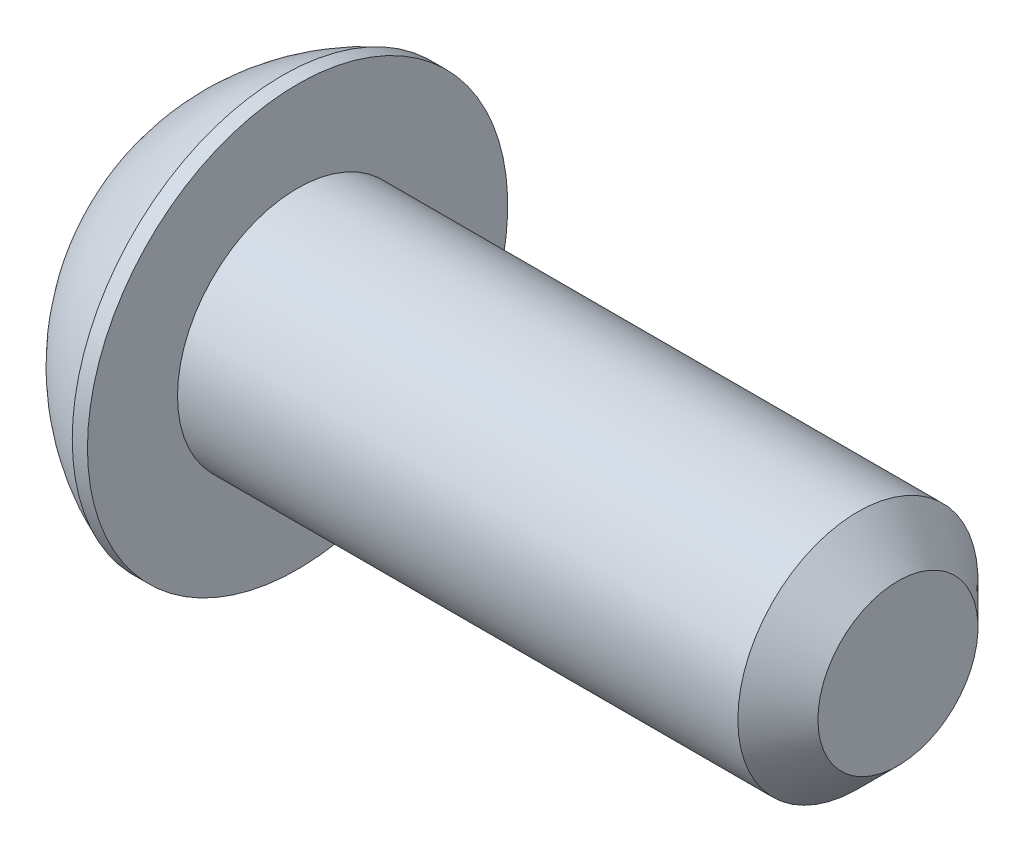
ISO-10303-21;
HEADER;
FILE_DESCRIPTION(('STEP AP214'),'2;1');
FILE_NAME('part.step','',(''),(''),'','','');
FILE_SCHEMA(('AUTOMOTIVE_DESIGN { 1 0 10303 214 1 1 1 1 }'));
ENDSEC;
DATA;
#1=APPLICATION_CONTEXT('core data for automotive mechanical design processes');
#2=APPLICATION_PROTOCOL_DEFINITION('international standard','automotive_design',2000,#1);
#3=PRODUCT_CONTEXT('',#1,'mechanical');
#4=PRODUCT('Part','Part','',(#3));
#5=PRODUCT_RELATED_PRODUCT_CATEGORY('part','',(#4));
#6=PRODUCT_DEFINITION_FORMATION('','',#4);
#7=PRODUCT_DEFINITION_CONTEXT('part definition',#1,'design');
#8=PRODUCT_DEFINITION('design','',#6,#7);
#9=PRODUCT_DEFINITION_SHAPE('','',#8);
#10=(LENGTH_UNIT() NAMED_UNIT(*) SI_UNIT(.MILLI.,.METRE.));
#11=(NAMED_UNIT(*) PLANE_ANGLE_UNIT() SI_UNIT($,.RADIAN.));
#12=(NAMED_UNIT(*) SI_UNIT($,.STERADIAN.) SOLID_ANGLE_UNIT());
#13=UNCERTAINTY_MEASURE_WITH_UNIT(LENGTH_MEASURE(1.E-05),#10,'distance_accuracy_value','');
#14=(GEOMETRIC_REPRESENTATION_CONTEXT(3) GLOBAL_UNCERTAINTY_ASSIGNED_CONTEXT((#13)) GLOBAL_UNIT_ASSIGNED_CONTEXT((#10,
#11,#12)) REPRESENTATION_CONTEXT('',''));
#15=CARTESIAN_POINT('',(0.,0.,0.));
#16=DIRECTION('',(0.,0.,1.));
#17=DIRECTION('',(1.,0.,0.));
#18=AXIS2_PLACEMENT_3D('',#15,#16,#17);
#19=CARTESIAN_POINT('',(0.,0.,0.));
#20=DIRECTION('',(-1.,0.,0.));
#21=DIRECTION('',(0.,0.,1.));
#22=AXIS2_PLACEMENT_3D('',#19,#20,#21);
#23=PLANE('',#22);
#24=CARTESIAN_POINT('',(0.,0.,0.));
#25=DIRECTION('',(-1.,0.,0.));
#26=DIRECTION('',(0.,0.,1.));
#27=AXIS2_PLACEMENT_3D('',#24,#25,#26);
#28=CIRCLE('',#27,2.625);
#29=CARTESIAN_POINT('',(0.,2.625,0.));
#30=VERTEX_POINT('',#29);
#31=EDGE_CURVE('E11',#30,#30,#28,.T.);
#32=ORIENTED_EDGE('',*,*,#31,.T.);
#33=EDGE_LOOP('',(#32));
#34=FACE_BOUND('',#33,.T.);
#35=DIRECTION('',(0.,-1.,0.));
#36=VECTOR('',#35,1.);
#37=CARTESIAN_POINT('',(0.,-1.15470053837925,2.));
#38=LINE('',#37,#36);
#39=CARTESIAN_POINT('',(0.,1.15470053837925,2.));
#40=VERTEX_POINT('',#39);
#41=CARTESIAN_POINT('',(0.,-1.15470053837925,2.));
#42=VERTEX_POINT('',#41);
#43=EDGE_CURVE('E55',#40,#42,#38,.T.);
#44=ORIENTED_EDGE('',*,*,#43,.T.);
#45=DIRECTION('',(0.,-0.5,-0.866025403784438));
#46=VECTOR('',#45,1.);
#47=CARTESIAN_POINT('',(0.,-2.3094010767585,0.));
#48=LINE('',#47,#46);
#49=CARTESIAN_POINT('',(0.,-2.3094010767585,0.));
#50=VERTEX_POINT('',#49);
#51=EDGE_CURVE('E381',#42,#50,#48,.T.);
#52=ORIENTED_EDGE('',*,*,#51,.T.);
#53=DIRECTION('',(0.,0.5,-0.866025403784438));
#54=VECTOR('',#53,1.);
#55=CARTESIAN_POINT('',(0.,-1.15470053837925,-2.));
#56=LINE('',#55,#54);
#57=CARTESIAN_POINT('',(0.,-1.15470053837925,-2.));
#58=VERTEX_POINT('',#57);
#59=EDGE_CURVE('E135',#50,#58,#56,.T.);
#60=ORIENTED_EDGE('',*,*,#59,.T.);
#61=DIRECTION('',(0.,1.,0.));
#62=VECTOR('',#61,1.);
#63=CARTESIAN_POINT('',(0.,1.15470053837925,-2.));
#64=LINE('',#63,#62);
#65=CARTESIAN_POINT('',(0.,1.15470053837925,-2.));
#66=VERTEX_POINT('',#65);
#67=EDGE_CURVE('E384',#58,#66,#64,.T.);
#68=ORIENTED_EDGE('',*,*,#67,.T.);
#69=DIRECTION('',(0.,0.5,0.866025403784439));
#70=VECTOR('',#69,1.);
#71=CARTESIAN_POINT('',(0.,2.3094010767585,0.));
#72=LINE('',#71,#70);
#73=CARTESIAN_POINT('',(0.,2.3094010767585,0.));
#74=VERTEX_POINT('',#73);
#75=EDGE_CURVE('E387',#66,#74,#72,.T.);
#76=ORIENTED_EDGE('',*,*,#75,.T.);
#77=DIRECTION('',(0.,-0.5,0.866025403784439));
#78=VECTOR('',#77,1.);
#79=CARTESIAN_POINT('',(0.,1.15470053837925,2.));
#80=LINE('',#79,#78);
#81=EDGE_CURVE('E389',#74,#40,#80,.T.);
#82=ORIENTED_EDGE('',*,*,#81,.T.);
#83=EDGE_LOOP('',(#44,#52,#60,#68,#76,#82));
#84=FACE_BOUND('',#83,.T.);
#85=ADVANCED_FACE('F40',(#34,#84),#23,.T.);
#86=CARTESIAN_POINT('',(4.99970462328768,0.,0.));
#87=DIRECTION('',(-1.,0.,0.));
#88=DIRECTION('',(0.,1.,0.));
#89=AXIS2_PLACEMENT_3D('',#86,#87,#88);
#90=SPHERICAL_SURFACE('',#89,5.64691697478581);
#91=CARTESIAN_POINT('',(2.92,0.,0.));
#92=DIRECTION('',(-1.,0.,0.));
#93=DIRECTION('',(0.,0.,1.));
#94=AXIS2_PLACEMENT_3D('',#91,#92,#93);
#95=CIRCLE('',#94,5.25);
#96=CARTESIAN_POINT('',(2.92,5.25,0.));
#97=VERTEX_POINT('',#96);
#98=EDGE_CURVE('E48',#97,#97,#95,.T.);
#99=CARTESIAN_POINT('',(2.92,5.25,0.));
#100=CARTESIAN_POINT('',(2.88116333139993,5.23461555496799,0.));
#101=CARTESIAN_POINT('',(2.84249743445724,5.21880002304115,0.));
#102=CARTESIAN_POINT('',(2.76552608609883,5.18631490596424,0.));
#103=CARTESIAN_POINT('',(2.72722063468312,5.16964532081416,0.));
#104=CARTESIAN_POINT('',(2.65098907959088,5.13546021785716,0.));
#105=CARTESIAN_POINT('',(2.61306297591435,5.11794470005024,0.));
#106=CARTESIAN_POINT('',(2.5376087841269,5.08207638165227,0.));
#107=CARTESIAN_POINT('',(2.50008069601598,5.06372358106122,0.));
#108=CARTESIAN_POINT('',(2.42544101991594,5.02618972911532,0.));
#109=CARTESIAN_POINT('',(2.38832943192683,5.00700867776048,0.));
#110=CARTESIAN_POINT('',(2.31454103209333,4.9678277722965,0.));
#111=CARTESIAN_POINT('',(2.27786422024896,4.94782791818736,0.));
#112=CARTESIAN_POINT('',(2.204963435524,4.90701925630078,0.));
#113=CARTESIAN_POINT('',(2.16873946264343,4.88621044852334,0.));
#114=CARTESIAN_POINT('',(2.09676219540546,4.84379412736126,0.));
#115=CARTESIAN_POINT('',(2.06100890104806,4.82218661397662,0.));
#116=CARTESIAN_POINT('',(1.9899905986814,4.77818352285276,0.));
#117=CARTESIAN_POINT('',(1.95472559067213,4.75578794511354,0.));
#118=CARTESIAN_POINT('',(1.88470122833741,4.7102197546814,0.));
#119=CARTESIAN_POINT('',(1.84994187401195,4.68704714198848,0.));
#120=CARTESIAN_POINT('',(1.78094593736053,4.63993629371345,0.));
#121=CARTESIAN_POINT('',(1.74670935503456,4.61599805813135,0.));
#122=CARTESIAN_POINT('',(1.67877582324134,4.56736775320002,0.));
#123=CARTESIAN_POINT('',(1.6450788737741,4.54267568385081,0.));
#124=CARTESIAN_POINT('',(1.57824120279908,4.4925498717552,0.));
#125=CARTESIAN_POINT('',(1.54510048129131,4.46711612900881,0.));
#126=CARTESIAN_POINT('',(1.4793915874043,4.4155194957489,0.));
#127=CARTESIAN_POINT('',(1.44682341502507,4.38935660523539,0.));
#128=CARTESIAN_POINT('',(1.3822756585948,4.33631456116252,0.));
#129=CARTESIAN_POINT('',(1.35029607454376,4.30943540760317,0.));
#130=CARTESIAN_POINT('',(1.28694124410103,4.2549740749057,0.));
#131=CARTESIAN_POINT('',(1.25556599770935,4.22739189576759,0.));
#132=CARTESIAN_POINT('',(1.19343529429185,4.17153809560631,0.));
#133=CARTESIAN_POINT('',(1.16267983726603,4.14326647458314,0.));
#134=CARTESIAN_POINT('',(1.10180385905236,4.0860477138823,0.));
#135=CARTESIAN_POINT('',(1.07168333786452,4.05710057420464,0.));
#136=CARTESIAN_POINT('',(1.01209206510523,3.99854503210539,0.));
#137=CARTESIAN_POINT('',(0.982621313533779,3.96893662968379,0.));
#138=CARTESIAN_POINT('',(0.924344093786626,3.90907314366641,0.));
#139=CARTESIAN_POINT('',(0.895537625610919,3.87881806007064,0.));
#140=CARTESIAN_POINT('',(0.838603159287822,3.8176761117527,0.));
#141=CARTESIAN_POINT('',(0.810475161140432,3.78678924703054,0.));
#142=CARTESIAN_POINT('',(0.754911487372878,3.72439894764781,0.));
#143=CARTESIAN_POINT('',(0.727475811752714,3.69289551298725,0.));
#144=CARTESIAN_POINT('',(0.673310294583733,3.62928758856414,0.));
#145=CARTESIAN_POINT('',(0.646580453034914,3.59718309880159,0.));
#146=CARTESIAN_POINT('',(0.593839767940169,3.53238887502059,0.));
#147=CARTESIAN_POINT('',(0.567828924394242,3.49969914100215,0.));
#148=CARTESIAN_POINT('',(0.516539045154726,3.43375052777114,0.));
#149=CARTESIAN_POINT('',(0.491260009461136,3.40049164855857,0.));
#150=CARTESIAN_POINT('',(0.441446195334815,3.33342112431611,0.));
#151=CARTESIAN_POINT('',(0.416911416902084,3.29960947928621,0.));
#152=CARTESIAN_POINT('',(0.368598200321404,3.23145007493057,0.));
#153=CARTESIAN_POINT('',(0.344819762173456,3.19710231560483,0.));
#154=CARTESIAN_POINT('',(0.298030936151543,3.12788759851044,0.));
#155=CARTESIAN_POINT('',(0.275020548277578,3.09302064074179,0.));
#156=CARTESIAN_POINT('',(0.229779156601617,3.02278469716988,0.));
#157=CARTESIAN_POINT('',(0.207548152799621,2.98741571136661,0.));
#158=CARTESIAN_POINT('',(0.163876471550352,2.91619313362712,0.));
#159=CARTESIAN_POINT('',(0.142435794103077,2.8803395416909,0.));
#160=CARTESIAN_POINT('',(0.100355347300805,2.80816539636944,0.));
#161=CARTESIAN_POINT('',(0.0797155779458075,2.7718448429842,0.));
#162=CARTESIAN_POINT('',(0.0392470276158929,2.69875470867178,0.));
#163=CARTESIAN_POINT('',(0.0194182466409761,2.66198512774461,0.));
#164=CARTESIAN_POINT('',(0.,2.625,0.));
#165=B_SPLINE_CURVE_WITH_KNOTS('',3,(#99,#100,#101,#102,#103,#104,#105,#106,#107,#108,#109,#110,
#111,#112,#113,#114,#115,#116,#117,#118,#119,#120,#121,#122,#123,#124,#125,#126,#127,#128,#129,
#130,#131,#132,#133,#134,#135,#136,#137,#138,#139,#140,#141,#142,#143,#144,#145,#146,#147,#148,
#149,#150,#151,#152,#153,#154,#155,#156,#157,#158,#159,#160,#161,#162,#163,#164),.UNSPECIFIED.,
.F.,.F.,(4,2,2,2,2,2,2,2,2,2,2,2,2,2,2,2,2,2,2,2,2,2,2,2,2,2,2,2,2,2,2,2,4),(0.,
0.12531586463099,0.25063172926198,0.37594759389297,0.50126345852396,0.62657932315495,
0.75189518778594,0.877211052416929,1.00252691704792,1.12784278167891,1.2531586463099,
1.37847451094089,1.50379037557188,1.62910624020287,1.75442210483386,1.87973796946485,
2.00505383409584,2.13036969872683,2.25568556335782,2.38100142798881,2.5063172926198,
2.63163315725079,2.75694902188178,2.88226488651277,3.00758075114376,3.13289661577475,
3.25821248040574,3.38352834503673,3.50884420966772,3.63416007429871,3.7594759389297,
3.88479180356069,4.01010766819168),.UNSPECIFIED.);
#166=EDGE_CURVE('BSEAM167',#97,#30,#165,.T.);
#167=ORIENTED_EDGE('',*,*,#98,.T.);
#168=ORIENTED_EDGE('',*,*,#31,.F.);
#169=ORIENTED_EDGE('',*,*,#166,.T.);
#170=ORIENTED_EDGE('',*,*,#166,.F.);
#171=EDGE_LOOP('',(#167,#169,#168,#170));
#172=FACE_BOUND('',#171,.T.);
#173=ADVANCED_FACE('F167',(#172),#90,.T.);
#174=CARTESIAN_POINT('',(0.,0.,0.));
#175=DIRECTION('',(-1.,0.,0.));
#176=DIRECTION('',(0.,0.,1.));
#177=AXIS2_PLACEMENT_3D('',#174,#175,#176);
#178=CYLINDRICAL_SURFACE('',#177,5.25);
#179=ORIENTED_EDGE('',*,*,#98,.F.);
#180=EDGE_LOOP('',(#179));
#181=FACE_BOUND('',#180,.T.);
#182=CARTESIAN_POINT('',(3.3,0.,0.));
#183=DIRECTION('',(-1.,0.,0.));
#184=DIRECTION('',(0.,0.,1.));
#185=AXIS2_PLACEMENT_3D('',#182,#183,#184);
#186=CIRCLE('',#185,5.25);
#187=CARTESIAN_POINT('',(3.3,0.,5.25));
#188=VERTEX_POINT('',#187);
#189=EDGE_CURVE('E161',#188,#188,#186,.T.);
#190=ORIENTED_EDGE('',*,*,#189,.T.);
#191=EDGE_LOOP('',(#190));
#192=FACE_BOUND('',#191,.T.);
#193=ADVANCED_FACE('F170',(#181,#192),#178,.T.);
#194=CARTESIAN_POINT('',(3.3,3.,0.));
#195=DIRECTION('',(-1.,0.,0.));
#196=DIRECTION('',(0.,0.,1.));
#197=AXIS2_PLACEMENT_3D('',#194,#195,#196);
#198=PLANE('',#197);
#199=ORIENTED_EDGE('',*,*,#189,.F.);
#200=EDGE_LOOP('',(#199));
#201=FACE_BOUND('',#200,.T.);
#202=CARTESIAN_POINT('',(3.3,0.,0.));
#203=DIRECTION('',(-1.,0.,0.));
#204=DIRECTION('',(0.,0.,1.));
#205=AXIS2_PLACEMENT_3D('',#202,#203,#204);
#206=CIRCLE('',#205,3.);
#207=CARTESIAN_POINT('',(3.3,0.,3.));
#208=VERTEX_POINT('',#207);
#209=EDGE_CURVE('E158',#208,#208,#206,.T.);
#210=ORIENTED_EDGE('',*,*,#209,.T.);
#211=EDGE_LOOP('',(#210));
#212=FACE_BOUND('',#211,.T.);
#213=ADVANCED_FACE('F173',(#201,#212),#198,.F.);
#214=CARTESIAN_POINT('',(0.,0.,0.));
#215=DIRECTION('',(-1.,0.,0.));
#216=DIRECTION('',(0.,0.,1.));
#217=AXIS2_PLACEMENT_3D('',#214,#215,#216);
#218=CYLINDRICAL_SURFACE('',#217,3.);
#219=ORIENTED_EDGE('',*,*,#209,.F.);
#220=EDGE_LOOP('',(#219));
#221=FACE_BOUND('',#220,.T.);
#222=CARTESIAN_POINT('',(17.3,0.,0.));
#223=DIRECTION('',(-1.,0.,0.));
#224=DIRECTION('',(0.,0.,1.));
#225=AXIS2_PLACEMENT_3D('',#222,#223,#224);
#226=CIRCLE('',#225,3.);
#227=CARTESIAN_POINT('',(17.3,0.,3.));
#228=VERTEX_POINT('',#227);
#229=EDGE_CURVE('E154',#228,#228,#226,.T.);
#230=ORIENTED_EDGE('',*,*,#229,.T.);
#231=EDGE_LOOP('',(#230));
#232=FACE_BOUND('',#231,.T.);
#233=ADVANCED_FACE('F179',(#221,#232),#218,.T.);
#234=CARTESIAN_POINT('',(18.3,0.,0.));
#235=DIRECTION('',(-1.,0.,0.));
#236=DIRECTION('',(0.,0.,1.));
#237=AXIS2_PLACEMENT_3D('',#234,#235,#236);
#238=CONICAL_SURFACE('',#237,2.,0.785398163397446);
#239=ORIENTED_EDGE('',*,*,#229,.F.);
#240=EDGE_LOOP('',(#239));
#241=FACE_BOUND('',#240,.T.);
#242=CARTESIAN_POINT('',(18.3,0.,0.));
#243=DIRECTION('',(-1.,0.,0.));
#244=DIRECTION('',(0.,0.,1.));
#245=AXIS2_PLACEMENT_3D('',#242,#243,#244);
#246=CIRCLE('',#245,2.);
#247=CARTESIAN_POINT('',(18.3,0.,2.));
#248=VERTEX_POINT('',#247);
#249=EDGE_CURVE('E150',#248,#248,#246,.T.);
#250=ORIENTED_EDGE('',*,*,#249,.T.);
#251=EDGE_LOOP('',(#250));
#252=FACE_BOUND('',#251,.T.);
#253=ADVANCED_FACE('F185',(#241,#252),#238,.T.);
#254=CARTESIAN_POINT('',(18.3,0.,0.));
#255=DIRECTION('',(-1.,0.,0.));
#256=DIRECTION('',(0.,0.,1.));
#257=AXIS2_PLACEMENT_3D('',#254,#255,#256);
#258=PLANE('',#257);
#259=ORIENTED_EDGE('',*,*,#249,.F.);
#260=EDGE_LOOP('',(#259));
#261=FACE_BOUND('',#260,.T.);
#262=ADVANCED_FACE('F191',(#261),#258,.F.);
#263=CARTESIAN_POINT('',(2.08,-2.3094010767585,0.));
#264=DIRECTION('',(0.,0.866025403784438,-0.500000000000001));
#265=DIRECTION('',(0.,0.500000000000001,0.866025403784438));
#266=AXIS2_PLACEMENT_3D('',#263,#264,#265);
#267=PLANE('',#266);
#268=DIRECTION('',(0.,-0.5,-0.866025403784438));
#269=VECTOR('',#268,1.);
#270=CARTESIAN_POINT('',(2.08,-2.3094010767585,0.));
#271=LINE('',#270,#269);
#272=CARTESIAN_POINT('',(2.08,-1.15470053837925,2.));
#273=VERTEX_POINT('',#272);
#274=CARTESIAN_POINT('',(2.08,-1.73205080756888,1.));
#275=VERTEX_POINT('',#274);
#276=EDGE_CURVE('E121',#273,#275,#271,.T.);
#277=ORIENTED_EDGE('',*,*,#276,.T.);
#278=CARTESIAN_POINT('',(2.08,-2.3094010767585,0.));
#279=VERTEX_POINT('',#278);
#280=EDGE_CURVE('E116',#275,#279,#271,.T.);
#281=ORIENTED_EDGE('',*,*,#280,.T.);
#282=DIRECTION('',(-1.,0.,0.));
#283=VECTOR('',#282,1.);
#284=CARTESIAN_POINT('',(2.08,-2.3094010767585,0.));
#285=LINE('',#284,#283);
#286=EDGE_CURVE('E118',#279,#50,#285,.T.);
#287=ORIENTED_EDGE('',*,*,#286,.T.);
#288=ORIENTED_EDGE('',*,*,#51,.F.);
#289=DIRECTION('',(-1.,0.,0.));
#290=VECTOR('',#289,1.);
#291=CARTESIAN_POINT('',(2.08,-1.15470053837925,2.));
#292=LINE('',#291,#290);
#293=EDGE_CURVE('E376',#273,#42,#292,.T.);
#294=ORIENTED_EDGE('',*,*,#293,.F.);
#295=EDGE_LOOP('',(#277,#281,#287,#288,#294));
#296=FACE_BOUND('',#295,.T.);
#297=ADVANCED_FACE('F117',(#296),#267,.T.);
#298=CARTESIAN_POINT('',(2.08,-1.15470053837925,-2.));
#299=DIRECTION('',(0.,0.866025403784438,0.5));
#300=DIRECTION('',(0.,-0.5,0.866025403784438));
#301=AXIS2_PLACEMENT_3D('',#298,#299,#300);
#302=PLANE('',#301);
#303=DIRECTION('',(0.,0.5,-0.866025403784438));
#304=VECTOR('',#303,1.);
#305=CARTESIAN_POINT('',(2.08,-1.15470053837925,-2.));
#306=LINE('',#305,#304);
#307=CARTESIAN_POINT('',(2.08,-1.73205080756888,-1.));
#308=VERTEX_POINT('',#307);
#309=EDGE_CURVE('E63',#279,#308,#306,.T.);
#310=ORIENTED_EDGE('',*,*,#309,.T.);
#311=CARTESIAN_POINT('',(2.08,-1.15470053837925,-2.));
#312=VERTEX_POINT('',#311);
#313=EDGE_CURVE('E130',#308,#312,#306,.T.);
#314=ORIENTED_EDGE('',*,*,#313,.T.);
#315=DIRECTION('',(-1.,0.,0.));
#316=VECTOR('',#315,1.);
#317=CARTESIAN_POINT('',(2.08,-1.15470053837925,-2.));
#318=LINE('',#317,#316);
#319=EDGE_CURVE('E137',#312,#58,#318,.T.);
#320=ORIENTED_EDGE('',*,*,#319,.T.);
#321=ORIENTED_EDGE('',*,*,#59,.F.);
#322=ORIENTED_EDGE('',*,*,#286,.F.);
#323=EDGE_LOOP('',(#310,#314,#320,#321,#322));
#324=FACE_BOUND('',#323,.T.);
#325=ADVANCED_FACE('F133',(#324),#302,.T.);
#326=CARTESIAN_POINT('',(2.08,1.15470053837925,-2.));
#327=DIRECTION('',(0.,0.,1.));
#328=DIRECTION('',(1.,0.,0.));
#329=AXIS2_PLACEMENT_3D('',#326,#327,#328);
#330=PLANE('',#329);
#331=DIRECTION('',(0.,1.,0.));
#332=VECTOR('',#331,1.);
#333=CARTESIAN_POINT('',(2.08,1.15470053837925,-2.));
#334=LINE('',#333,#332);
#335=CARTESIAN_POINT('',(2.08,0.,-2.));
#336=VERTEX_POINT('',#335);
#337=EDGE_CURVE('E410',#312,#336,#334,.T.);
#338=ORIENTED_EDGE('',*,*,#337,.T.);
#339=CARTESIAN_POINT('',(2.08,1.15470053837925,-2.));
#340=VERTEX_POINT('',#339);
#341=EDGE_CURVE('E129',#336,#340,#334,.T.);
#342=ORIENTED_EDGE('',*,*,#341,.T.);
#343=DIRECTION('',(-1.,0.,0.));
#344=VECTOR('',#343,1.);
#345=CARTESIAN_POINT('',(2.08,1.15470053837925,-2.));
#346=LINE('',#345,#344);
#347=EDGE_CURVE('E144',#340,#66,#346,.T.);
#348=ORIENTED_EDGE('',*,*,#347,.T.);
#349=ORIENTED_EDGE('',*,*,#67,.F.);
#350=ORIENTED_EDGE('',*,*,#319,.F.);
#351=EDGE_LOOP('',(#338,#342,#348,#349,#350));
#352=FACE_BOUND('',#351,.T.);
#353=ADVANCED_FACE('F255',(#352),#330,.T.);
#354=CARTESIAN_POINT('',(2.08,2.3094010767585,0.));
#355=DIRECTION('',(0.,-0.866025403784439,0.5));
#356=DIRECTION('',(0.,-0.5,-0.866025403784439));
#357=AXIS2_PLACEMENT_3D('',#354,#355,#356);
#358=PLANE('',#357);
#359=DIRECTION('',(0.,0.5,0.866025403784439));
#360=VECTOR('',#359,1.);
#361=CARTESIAN_POINT('',(2.08,2.3094010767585,0.));
#362=LINE('',#361,#360);
#363=CARTESIAN_POINT('',(2.08,1.73205080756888,-0.999999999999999));
#364=VERTEX_POINT('',#363);
#365=EDGE_CURVE('E414',#340,#364,#362,.T.);
#366=ORIENTED_EDGE('',*,*,#365,.T.);
#367=CARTESIAN_POINT('',(2.08,2.3094010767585,0.));
#368=VERTEX_POINT('',#367);
#369=EDGE_CURVE('E412',#364,#368,#362,.T.);
#370=ORIENTED_EDGE('',*,*,#369,.T.);
#371=DIRECTION('',(-1.,0.,0.));
#372=VECTOR('',#371,1.);
#373=CARTESIAN_POINT('',(2.08,2.3094010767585,0.));
#374=LINE('',#373,#372);
#375=EDGE_CURVE('E395',#368,#74,#374,.T.);
#376=ORIENTED_EDGE('',*,*,#375,.T.);
#377=ORIENTED_EDGE('',*,*,#75,.F.);
#378=ORIENTED_EDGE('',*,*,#347,.F.);
#379=EDGE_LOOP('',(#366,#370,#376,#377,#378));
#380=FACE_BOUND('',#379,.T.);
#381=ADVANCED_FACE('F264',(#380),#358,.T.);
#382=CARTESIAN_POINT('',(2.08,1.15470053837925,2.));
#383=DIRECTION('',(0.,-0.866025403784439,-0.5));
#384=DIRECTION('',(0.,0.5,-0.866025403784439));
#385=AXIS2_PLACEMENT_3D('',#382,#383,#384);
#386=PLANE('',#385);
#387=DIRECTION('',(0.,-0.5,0.866025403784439));
#388=VECTOR('',#387,1.);
#389=CARTESIAN_POINT('',(2.08,1.15470053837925,2.));
#390=LINE('',#389,#388);
#391=CARTESIAN_POINT('',(2.08,1.73205080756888,0.999999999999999));
#392=VERTEX_POINT('',#391);
#393=EDGE_CURVE('E371',#368,#392,#390,.T.);
#394=ORIENTED_EDGE('',*,*,#393,.T.);
#395=CARTESIAN_POINT('',(2.08,1.15470053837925,2.));
#396=VERTEX_POINT('',#395);
#397=EDGE_CURVE('E367',#392,#396,#390,.T.);
#398=ORIENTED_EDGE('',*,*,#397,.T.);
#399=DIRECTION('',(-1.,0.,0.));
#400=VECTOR('',#399,1.);
#401=CARTESIAN_POINT('',(2.08,1.15470053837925,2.));
#402=LINE('',#401,#400);
#403=EDGE_CURVE('E375',#396,#40,#402,.T.);
#404=ORIENTED_EDGE('',*,*,#403,.T.);
#405=ORIENTED_EDGE('',*,*,#81,.F.);
#406=ORIENTED_EDGE('',*,*,#375,.F.);
#407=EDGE_LOOP('',(#394,#398,#404,#405,#406));
#408=FACE_BOUND('',#407,.T.);
#409=ADVANCED_FACE('F274',(#408),#386,.T.);
#410=CARTESIAN_POINT('',(2.08,-1.15470053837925,2.));
#411=DIRECTION('',(0.,0.,-1.));
#412=DIRECTION('',(-1.,0.,0.));
#413=AXIS2_PLACEMENT_3D('',#410,#411,#412);
#414=PLANE('',#413);
#415=DIRECTION('',(0.,-1.,0.));
#416=VECTOR('',#415,1.);
#417=CARTESIAN_POINT('',(2.08,-1.15470053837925,2.));
#418=LINE('',#417,#416);
#419=CARTESIAN_POINT('',(2.08,0.,2.));
#420=VERTEX_POINT('',#419);
#421=EDGE_CURVE('E366',#396,#420,#418,.T.);
#422=ORIENTED_EDGE('',*,*,#421,.T.);
#423=EDGE_CURVE('E369',#420,#273,#418,.T.);
#424=ORIENTED_EDGE('',*,*,#423,.T.);
#425=ORIENTED_EDGE('',*,*,#293,.T.);
#426=ORIENTED_EDGE('',*,*,#43,.F.);
#427=ORIENTED_EDGE('',*,*,#403,.F.);
#428=EDGE_LOOP('',(#422,#424,#425,#426,#427));
#429=FACE_BOUND('',#428,.T.);
#430=ADVANCED_FACE('F284',(#429),#414,.T.);
#431=CARTESIAN_POINT('',(2.08,-2.3094010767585,0.));
#432=DIRECTION('',(1.,0.,0.));
#433=DIRECTION('',(0.,0.,-1.));
#434=AXIS2_PLACEMENT_3D('',#431,#432,#433);
#435=PLANE('',#434);
#436=CARTESIAN_POINT('',(2.08,0.,0.));
#437=DIRECTION('',(-1.,0.,0.));
#438=DIRECTION('',(0.,0.,1.));
#439=AXIS2_PLACEMENT_3D('',#436,#437,#438);
#440=CIRCLE('',#439,2.);
#441=EDGE_CURVE('E418',#364,#336,#440,.T.);
#442=ORIENTED_EDGE('',*,*,#441,.F.);
#443=ORIENTED_EDGE('',*,*,#365,.F.);
#444=ORIENTED_EDGE('',*,*,#341,.F.);
#445=EDGE_LOOP('',(#442,#443,#444));
#446=FACE_BOUND('',#445,.T.);
#447=ADVANCED_FACE('F294',(#446),#435,.F.);
#448=EDGE_CURVE('E151',#392,#364,#440,.T.);
#449=ORIENTED_EDGE('',*,*,#448,.F.);
#450=ORIENTED_EDGE('',*,*,#393,.F.);
#451=ORIENTED_EDGE('',*,*,#369,.F.);
#452=EDGE_LOOP('',(#449,#450,#451));
#453=FACE_BOUND('',#452,.T.);
#454=ADVANCED_FACE('F304',(#453),#435,.F.);
#455=EDGE_CURVE('E142',#420,#392,#440,.T.);
#456=ORIENTED_EDGE('',*,*,#455,.F.);
#457=ORIENTED_EDGE('',*,*,#421,.F.);
#458=ORIENTED_EDGE('',*,*,#397,.F.);
#459=EDGE_LOOP('',(#456,#457,#458));
#460=FACE_BOUND('',#459,.T.);
#461=ADVANCED_FACE('F315',(#460),#435,.F.);
#462=EDGE_CURVE('E136',#275,#420,#440,.T.);
#463=ORIENTED_EDGE('',*,*,#462,.F.);
#464=ORIENTED_EDGE('',*,*,#276,.F.);
#465=ORIENTED_EDGE('',*,*,#423,.F.);
#466=EDGE_LOOP('',(#463,#464,#465));
#467=FACE_BOUND('',#466,.T.);
#468=ADVANCED_FACE('F324',(#467),#435,.F.);
#469=EDGE_CURVE('E127',#308,#275,#440,.T.);
#470=ORIENTED_EDGE('',*,*,#469,.F.);
#471=ORIENTED_EDGE('',*,*,#309,.F.);
#472=ORIENTED_EDGE('',*,*,#280,.F.);
#473=EDGE_LOOP('',(#470,#471,#472));
#474=FACE_BOUND('',#473,.T.);
#475=ADVANCED_FACE('F126',(#474),#435,.F.);
#476=EDGE_CURVE('E411',#336,#308,#440,.T.);
#477=ORIENTED_EDGE('',*,*,#476,.F.);
#478=ORIENTED_EDGE('',*,*,#337,.F.);
#479=ORIENTED_EDGE('',*,*,#313,.F.);
#480=EDGE_LOOP('',(#477,#478,#479));
#481=FACE_BOUND('',#480,.T.);
#482=ADVANCED_FACE('F307',(#481),#435,.F.);
#483=CARTESIAN_POINT('',(3.23470053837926,0.,0.));
#484=DIRECTION('',(-1.,0.,0.));
#485=DIRECTION('',(0.,0.,1.));
#486=AXIS2_PLACEMENT_3D('',#483,#484,#485);
#487=CONICAL_SURFACE('',#486,0.,1.04719755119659);
#488=ORIENTED_EDGE('',*,*,#455,.T.);
#489=ORIENTED_EDGE('',*,*,#448,.T.);
#490=ORIENTED_EDGE('',*,*,#441,.T.);
#491=ORIENTED_EDGE('',*,*,#476,.T.);
#492=ORIENTED_EDGE('',*,*,#469,.T.);
#493=ORIENTED_EDGE('',*,*,#462,.T.);
#494=EDGE_LOOP('',(#488,#489,#490,#491,#492,#493));
#495=FACE_BOUND('',#494,.T.);
#496=CARTESIAN_POINT('',(3.23470053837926,0.,0.));
#497=VERTEX_POINT('',#496);
#498=VERTEX_LOOP('',#497);
#499=FACE_BOUND('',#498,.T.);
#500=ADVANCED_FACE('F348',(#495,#499),#487,.F.);
#501=CLOSED_SHELL('',(#85,#173,#193,#213,#233,#253,#262,#297,#325,#353,#381,#409,#430,#447,#454,
#461,#468,#475,#482,#500));
#502=MANIFOLD_SOLID_BREP('B2',#501);
#503=ADVANCED_BREP_SHAPE_REPRESENTATION('',(#18,#502),#14);
#504=SHAPE_DEFINITION_REPRESENTATION(#9,#503);
ENDSEC;
END-ISO-10303-21;
